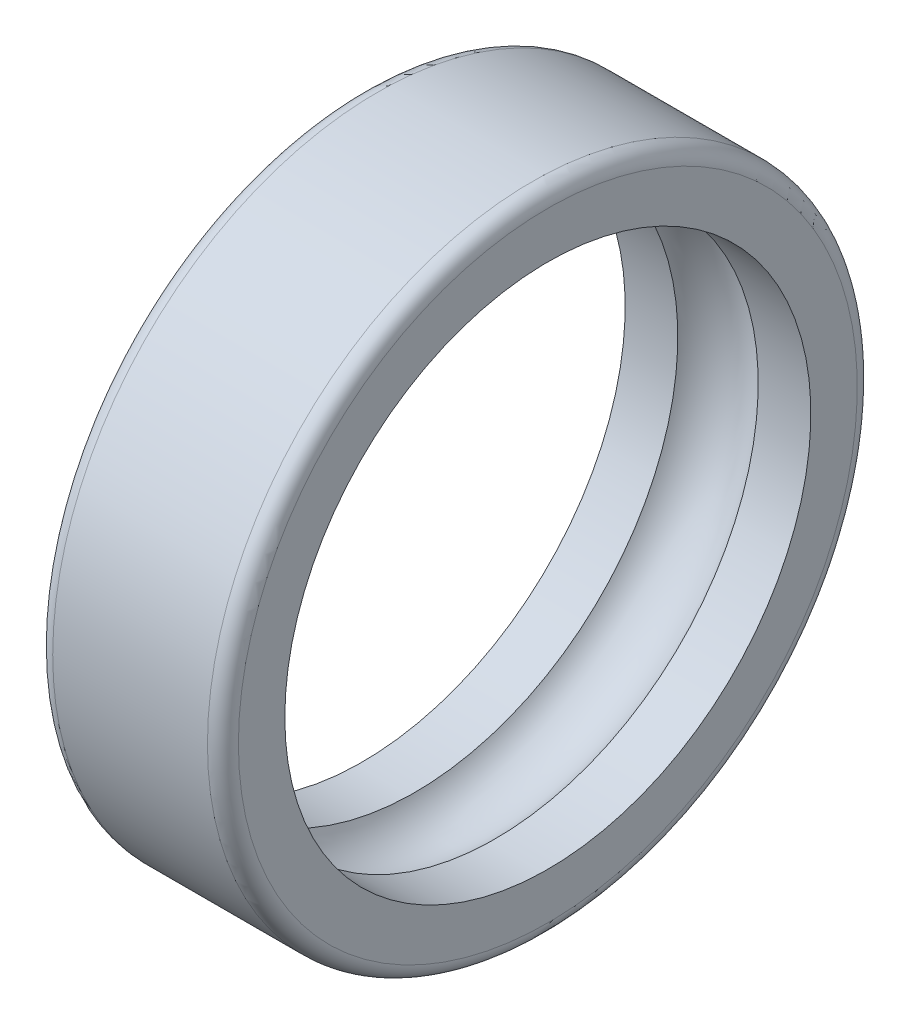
ISO-10303-21;
HEADER;
FILE_DESCRIPTION(('STEP AP214'),'2;1');
FILE_NAME('part.step','',(''),(''),'','','');
FILE_SCHEMA(('AUTOMOTIVE_DESIGN { 1 0 10303 214 1 1 1 1 }'));
ENDSEC;
DATA;
#1=APPLICATION_CONTEXT('core data for automotive mechanical design processes');
#2=APPLICATION_PROTOCOL_DEFINITION('international standard','automotive_design',2000,#1);
#3=PRODUCT_CONTEXT('',#1,'mechanical');
#4=PRODUCT('Part','Part','',(#3));
#5=PRODUCT_RELATED_PRODUCT_CATEGORY('part','',(#4));
#6=PRODUCT_DEFINITION_FORMATION('','',#4);
#7=PRODUCT_DEFINITION_CONTEXT('part definition',#1,'design');
#8=PRODUCT_DEFINITION('design','',#6,#7);
#9=PRODUCT_DEFINITION_SHAPE('','',#8);
#10=(LENGTH_UNIT() NAMED_UNIT(*) SI_UNIT(.MILLI.,.METRE.));
#11=(NAMED_UNIT(*) PLANE_ANGLE_UNIT() SI_UNIT($,.RADIAN.));
#12=(NAMED_UNIT(*) SI_UNIT($,.STERADIAN.) SOLID_ANGLE_UNIT());
#13=UNCERTAINTY_MEASURE_WITH_UNIT(LENGTH_MEASURE(1.E-05),#10,'distance_accuracy_value','');
#14=(GEOMETRIC_REPRESENTATION_CONTEXT(3) GLOBAL_UNCERTAINTY_ASSIGNED_CONTEXT((#13)) GLOBAL_UNIT_ASSIGNED_CONTEXT((#10,
#11,#12)) REPRESENTATION_CONTEXT('',''));
#15=CARTESIAN_POINT('',(0.,0.,0.));
#16=DIRECTION('',(0.,0.,1.));
#17=DIRECTION('',(1.,0.,0.));
#18=AXIS2_PLACEMENT_3D('',#15,#16,#17);
#19=CARTESIAN_POINT('',(-7.,104.5,0.));
#20=DIRECTION('',(1.,0.,0.));
#21=DIRECTION('',(0.,0.,-1.));
#22=AXIS2_PLACEMENT_3D('',#19,#20,#21);
#23=PLANE('',#22);
#24=CARTESIAN_POINT('',(-7.,87.5,0.));
#25=DIRECTION('',(-1.,0.,0.));
#26=DIRECTION('',(0.,0.,1.));
#27=AXIS2_PLACEMENT_3D('',#24,#25,#26);
#28=CIRCLE('',#27,17.);
#29=CARTESIAN_POINT('',(-7.,87.5,17.));
#30=VERTEX_POINT('',#29);
#31=EDGE_CURVE('E58',#30,#30,#28,.T.);
#32=ORIENTED_EDGE('',*,*,#31,.F.);
#33=EDGE_LOOP('',(#32));
#34=FACE_BOUND('',#33,.T.);
#35=CARTESIAN_POINT('',(-7.,87.5,0.));
#36=DIRECTION('',(-1.,0.,0.));
#37=DIRECTION('',(0.,0.,1.));
#38=AXIS2_PLACEMENT_3D('',#35,#36,#37);
#39=CIRCLE('',#38,20.);
#40=CARTESIAN_POINT('',(-7.,87.5,20.));
#41=VERTEX_POINT('',#40);
#42=EDGE_CURVE('E10',#41,#41,#39,.T.);
#43=ORIENTED_EDGE('',*,*,#42,.T.);
#44=EDGE_LOOP('',(#43));
#45=FACE_BOUND('',#44,.T.);
#46=ADVANCED_FACE('F30',(#34,#45),#23,.F.);
#47=CARTESIAN_POINT('',(-6.,87.5,0.));
#48=DIRECTION('',(-1.,0.,0.));
#49=DIRECTION('',(0.,0.,1.));
#50=AXIS2_PLACEMENT_3D('',#47,#48,#49);
#51=TOROIDAL_SURFACE('',#50,20.,1.);
#52=ORIENTED_EDGE('',*,*,#42,.F.);
#53=EDGE_LOOP('',(#52));
#54=FACE_BOUND('',#53,.T.);
#55=CARTESIAN_POINT('',(-6.,87.5,0.));
#56=DIRECTION('',(-1.,0.,0.));
#57=DIRECTION('',(0.,0.,1.));
#58=AXIS2_PLACEMENT_3D('',#55,#56,#57);
#59=CIRCLE('',#58,21.);
#60=CARTESIAN_POINT('',(-6.,87.5,21.));
#61=VERTEX_POINT('',#60);
#62=EDGE_CURVE('E36',#61,#61,#59,.T.);
#63=ORIENTED_EDGE('',*,*,#62,.T.);
#64=EDGE_LOOP('',(#63));
#65=FACE_BOUND('',#64,.T.);
#66=ADVANCED_FACE('F65',(#54,#65),#51,.T.);
#67=CARTESIAN_POINT('',(-11.189264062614,87.5,0.));
#68=DIRECTION('',(-1.,0.,0.));
#69=DIRECTION('',(0.,0.,1.));
#70=AXIS2_PLACEMENT_3D('',#67,#68,#69);
#71=CYLINDRICAL_SURFACE('',#70,21.);
#72=ORIENTED_EDGE('',*,*,#62,.F.);
#73=EDGE_LOOP('',(#72));
#74=FACE_BOUND('',#73,.T.);
#75=CARTESIAN_POINT('',(4.,87.5,0.));
#76=DIRECTION('',(-1.,0.,0.));
#77=DIRECTION('',(0.,0.,1.));
#78=AXIS2_PLACEMENT_3D('',#75,#76,#77);
#79=CIRCLE('',#78,21.);
#80=CARTESIAN_POINT('',(4.,87.5,21.));
#81=VERTEX_POINT('',#80);
#82=EDGE_CURVE('E40',#81,#81,#79,.T.);
#83=ORIENTED_EDGE('',*,*,#82,.T.);
#84=EDGE_LOOP('',(#83));
#85=FACE_BOUND('',#84,.T.);
#86=ADVANCED_FACE('F69',(#74,#85),#71,.T.);
#87=CARTESIAN_POINT('',(4.,87.5,0.));
#88=DIRECTION('',(-1.,0.,0.));
#89=DIRECTION('',(0.,0.,1.));
#90=AXIS2_PLACEMENT_3D('',#87,#88,#89);
#91=TOROIDAL_SURFACE('',#90,20.,1.);
#92=ORIENTED_EDGE('',*,*,#82,.F.);
#93=EDGE_LOOP('',(#92));
#94=FACE_BOUND('',#93,.T.);
#95=CARTESIAN_POINT('',(5.,87.5,0.));
#96=DIRECTION('',(-1.,0.,0.));
#97=DIRECTION('',(0.,0.,1.));
#98=AXIS2_PLACEMENT_3D('',#95,#96,#97);
#99=CIRCLE('',#98,20.);
#100=CARTESIAN_POINT('',(5.,87.5,20.));
#101=VERTEX_POINT('',#100);
#102=EDGE_CURVE('E44',#101,#101,#99,.T.);
#103=ORIENTED_EDGE('',*,*,#102,.T.);
#104=EDGE_LOOP('',(#103));
#105=FACE_BOUND('',#104,.T.);
#106=ADVANCED_FACE('F74',(#94,#105),#91,.T.);
#107=CARTESIAN_POINT('',(5.,104.5,0.));
#108=DIRECTION('',(-1.,0.,0.));
#109=DIRECTION('',(0.,0.,1.));
#110=AXIS2_PLACEMENT_3D('',#107,#108,#109);
#111=PLANE('',#110);
#112=ORIENTED_EDGE('',*,*,#102,.F.);
#113=EDGE_LOOP('',(#112));
#114=FACE_BOUND('',#113,.T.);
#115=CARTESIAN_POINT('',(5.,87.5,0.));
#116=DIRECTION('',(-1.,0.,0.));
#117=DIRECTION('',(0.,0.,1.));
#118=AXIS2_PLACEMENT_3D('',#115,#116,#117);
#119=CIRCLE('',#118,17.);
#120=CARTESIAN_POINT('',(5.,87.5,17.));
#121=VERTEX_POINT('',#120);
#122=EDGE_CURVE('E49',#121,#121,#119,.T.);
#123=ORIENTED_EDGE('',*,*,#122,.T.);
#124=EDGE_LOOP('',(#123));
#125=FACE_BOUND('',#124,.T.);
#126=ADVANCED_FACE('F80',(#114,#125),#111,.F.);
#127=CARTESIAN_POINT('',(-11.189264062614,87.5,0.));
#128=DIRECTION('',(-1.,0.,0.));
#129=DIRECTION('',(0.,0.,1.));
#130=AXIS2_PLACEMENT_3D('',#127,#128,#129);
#131=CYLINDRICAL_SURFACE('',#130,17.);
#132=ORIENTED_EDGE('',*,*,#122,.F.);
#133=EDGE_LOOP('',(#132));
#134=FACE_BOUND('',#133,.T.);
#135=CARTESIAN_POINT('',(1.59807621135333,87.5,0.));
#136=DIRECTION('',(-1.,0.,0.));
#137=DIRECTION('',(0.,0.,1.));
#138=AXIS2_PLACEMENT_3D('',#135,#136,#137);
#139=CIRCLE('',#138,17.);
#140=CARTESIAN_POINT('',(1.59807621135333,87.5,17.));
#141=VERTEX_POINT('',#140);
#142=EDGE_CURVE('E52',#141,#141,#139,.T.);
#143=ORIENTED_EDGE('',*,*,#142,.T.);
#144=EDGE_LOOP('',(#143));
#145=FACE_BOUND('',#144,.T.);
#146=ADVANCED_FACE('F84',(#134,#145),#131,.F.);
#147=CARTESIAN_POINT('',(-0.999999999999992,87.5,0.));
#148=DIRECTION('',(-1.,0.,0.));
#149=DIRECTION('',(0.,0.,1.));
#150=AXIS2_PLACEMENT_3D('',#147,#148,#149);
#151=TOROIDAL_SURFACE('',#150,15.5,3.);
#152=ORIENTED_EDGE('',*,*,#142,.F.);
#153=EDGE_LOOP('',(#152));
#154=FACE_BOUND('',#153,.T.);
#155=CARTESIAN_POINT('',(-3.59807621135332,87.5,0.));
#156=DIRECTION('',(-1.,0.,0.));
#157=DIRECTION('',(0.,0.,1.));
#158=AXIS2_PLACEMENT_3D('',#155,#156,#157);
#159=CIRCLE('',#158,17.);
#160=CARTESIAN_POINT('',(-3.59807621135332,87.5,17.));
#161=VERTEX_POINT('',#160);
#162=EDGE_CURVE('E55',#161,#161,#159,.T.);
#163=ORIENTED_EDGE('',*,*,#162,.T.);
#164=EDGE_LOOP('',(#163));
#165=FACE_BOUND('',#164,.T.);
#166=ADVANCED_FACE('F88',(#154,#165),#151,.F.);
#167=CARTESIAN_POINT('',(-11.189264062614,87.5,0.));
#168=DIRECTION('',(-1.,0.,0.));
#169=DIRECTION('',(0.,0.,1.));
#170=AXIS2_PLACEMENT_3D('',#167,#168,#169);
#171=CYLINDRICAL_SURFACE('',#170,17.);
#172=ORIENTED_EDGE('',*,*,#162,.F.);
#173=EDGE_LOOP('',(#172));
#174=FACE_BOUND('',#173,.T.);
#175=ORIENTED_EDGE('',*,*,#31,.T.);
#176=EDGE_LOOP('',(#175));
#177=FACE_BOUND('',#176,.T.);
#178=ADVANCED_FACE('F62',(#174,#177),#171,.F.);
#179=CLOSED_SHELL('',(#46,#66,#86,#106,#126,#146,#166,#178));
#180=MANIFOLD_SOLID_BREP('B2',#179);
#181=ADVANCED_BREP_SHAPE_REPRESENTATION('',(#18,#180),#14);
#182=SHAPE_DEFINITION_REPRESENTATION(#9,#181);
ENDSEC;
END-ISO-10303-21;
